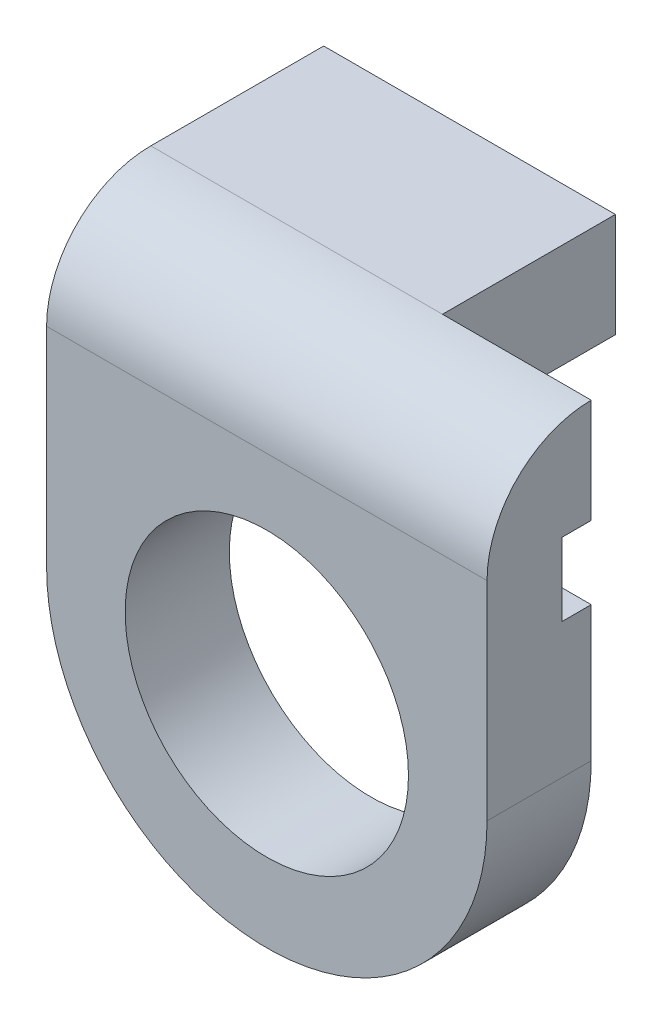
ISO-10303-21;
HEADER;
FILE_DESCRIPTION(('STEP AP214'),'2;1');
FILE_NAME('part.step','',(''),(''),'','','');
FILE_SCHEMA(('AUTOMOTIVE_DESIGN { 1 0 10303 214 1 1 1 1 }'));
ENDSEC;
DATA;
#1=APPLICATION_CONTEXT('core data for automotive mechanical design processes');
#2=APPLICATION_PROTOCOL_DEFINITION('international standard','automotive_design',2000,#1);
#3=PRODUCT_CONTEXT('',#1,'mechanical');
#4=PRODUCT('Part','Part','',(#3));
#5=PRODUCT_RELATED_PRODUCT_CATEGORY('part','',(#4));
#6=PRODUCT_DEFINITION_FORMATION('','',#4);
#7=PRODUCT_DEFINITION_CONTEXT('part definition',#1,'design');
#8=PRODUCT_DEFINITION('design','',#6,#7);
#9=PRODUCT_DEFINITION_SHAPE('','',#8);
#10=(LENGTH_UNIT() NAMED_UNIT(*) SI_UNIT(.MILLI.,.METRE.));
#11=(NAMED_UNIT(*) PLANE_ANGLE_UNIT() SI_UNIT($,.RADIAN.));
#12=(NAMED_UNIT(*) SI_UNIT($,.STERADIAN.) SOLID_ANGLE_UNIT());
#13=UNCERTAINTY_MEASURE_WITH_UNIT(LENGTH_MEASURE(1.E-05),#10,'distance_accuracy_value','');
#14=(GEOMETRIC_REPRESENTATION_CONTEXT(3) GLOBAL_UNCERTAINTY_ASSIGNED_CONTEXT((#13)) GLOBAL_UNIT_ASSIGNED_CONTEXT((#10,
#11,#12)) REPRESENTATION_CONTEXT('',''));
#15=CARTESIAN_POINT('',(0.,0.,0.));
#16=DIRECTION('',(0.,0.,1.));
#17=DIRECTION('',(1.,0.,0.));
#18=AXIS2_PLACEMENT_3D('',#15,#16,#17);
#19=CARTESIAN_POINT('',(-48.2574565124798,210.228483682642,-5.));
#20=DIRECTION('',(0.,0.,-1.));
#21=DIRECTION('',(-1.,0.,0.));
#22=AXIS2_PLACEMENT_3D('',#19,#20,#21);
#23=PLANE('',#22);
#24=DIRECTION('',(-1.,0.,0.));
#25=VECTOR('',#24,1.);
#26=CARTESIAN_POINT('',(-37.6880682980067,220.214717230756,-5.));
#27=LINE('',#26,#25);
#28=CARTESIAN_POINT('',(-37.6880932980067,220.214717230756,-5.));
#29=VERTEX_POINT('',#28);
#30=CARTESIAN_POINT('',(-44.8268197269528,220.214717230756,-5.));
#31=VERTEX_POINT('',#30);
#32=EDGE_CURVE('E215',#29,#31,#27,.T.);
#33=ORIENTED_EDGE('',*,*,#32,.T.);
#34=DIRECTION('',(0.,-1.,0.));
#35=VECTOR('',#34,1.);
#36=CARTESIAN_POINT('',(-44.8268197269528,220.214717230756,-5.));
#37=LINE('',#36,#35);
#38=CARTESIAN_POINT('',(-44.8268197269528,225.214717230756,-5.));
#39=VERTEX_POINT('',#38);
#40=EDGE_CURVE('E178',#39,#31,#37,.T.);
#41=ORIENTED_EDGE('',*,*,#40,.F.);
#42=DIRECTION('',(-1.,0.,0.));
#43=VECTOR('',#42,1.);
#44=CARTESIAN_POINT('',(-58.8268197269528,225.214717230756,-5.));
#45=LINE('',#44,#43);
#46=CARTESIAN_POINT('',(-37.6880932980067,225.214717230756,-5.));
#47=VERTEX_POINT('',#46);
#48=EDGE_CURVE('E150',#47,#39,#45,.T.);
#49=ORIENTED_EDGE('',*,*,#48,.F.);
#50=DIRECTION('',(0.,1.,0.));
#51=VECTOR('',#50,1.);
#52=CARTESIAN_POINT('',(-37.6880932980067,225.214717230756,-5.));
#53=LINE('',#52,#51);
#54=EDGE_CURVE('E152',#29,#47,#53,.T.);
#55=ORIENTED_EDGE('',*,*,#54,.F.);
#56=EDGE_LOOP('',(#33,#41,#49,#55));
#57=FACE_BOUND('',#56,.T.);
#58=ADVANCED_FACE('F32',(#57),#23,.T.);
#59=CARTESIAN_POINT('',(-58.8268197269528,225.214717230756,-5.));
#60=DIRECTION('',(0.,1.,0.));
#61=DIRECTION('',(-1.,0.,0.));
#62=AXIS2_PLACEMENT_3D('',#59,#60,#61);
#63=PLANE('',#62);
#64=DIRECTION('',(0.,0.,1.));
#65=VECTOR('',#64,1.);
#66=CARTESIAN_POINT('',(-58.8268197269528,225.214717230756,-5.));
#67=LINE('',#66,#65);
#68=CARTESIAN_POINT('',(-58.8268197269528,225.214717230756,-13.3));
#69=VERTEX_POINT('',#68);
#70=CARTESIAN_POINT('',(-58.8268197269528,225.214717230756,-5.));
#71=VERTEX_POINT('',#70);
#72=EDGE_CURVE('E172',#69,#71,#67,.T.);
#73=ORIENTED_EDGE('',*,*,#72,.T.);
#74=DIRECTION('',(-1.,0.,0.));
#75=VECTOR('',#74,1.);
#76=CARTESIAN_POINT('',(-37.6880932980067,225.214717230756,-5.));
#77=LINE('',#76,#75);
#78=EDGE_CURVE('E40',#71,#39,#77,.F.);
#79=ORIENTED_EDGE('',*,*,#78,.T.);
#80=DIRECTION('',(0.,0.,1.));
#81=VECTOR('',#80,1.);
#82=CARTESIAN_POINT('',(-44.8268197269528,225.214717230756,-13.3));
#83=LINE('',#82,#81);
#84=CARTESIAN_POINT('',(-44.8268197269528,225.214717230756,-13.3));
#85=VERTEX_POINT('',#84);
#86=EDGE_CURVE('E185',#85,#39,#83,.T.);
#87=ORIENTED_EDGE('',*,*,#86,.F.);
#88=DIRECTION('',(1.,0.,0.));
#89=VECTOR('',#88,1.);
#90=CARTESIAN_POINT('',(-58.8268197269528,225.214717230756,-13.3));
#91=LINE('',#90,#89);
#92=EDGE_CURVE('E181',#69,#85,#91,.T.);
#93=ORIENTED_EDGE('',*,*,#92,.F.);
#94=EDGE_LOOP('',(#73,#79,#87,#93));
#95=FACE_BOUND('',#94,.T.);
#96=ADVANCED_FACE('F34',(#95),#63,.T.);
#97=CARTESIAN_POINT('',(-37.6880932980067,225.214717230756,-5.));
#98=DIRECTION('',(1.,0.,0.));
#99=DIRECTION('',(0.,0.,-1.));
#100=AXIS2_PLACEMENT_3D('',#97,#98,#99);
#101=PLANE('',#100);
#102=ORIENTED_EDGE('',*,*,#54,.T.);
#103=CARTESIAN_POINT('',(-37.6880932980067,220.214717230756,-5.));
#104=DIRECTION('',(1.,0.,0.));
#105=DIRECTION('',(0.,0.,-1.));
#106=AXIS2_PLACEMENT_3D('',#103,#104,#105);
#107=CIRCLE('',#106,5.);
#108=CARTESIAN_POINT('',(-37.6880932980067,220.214717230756,0.));
#109=VERTEX_POINT('',#108);
#110=EDGE_CURVE('E11',#47,#109,#107,.T.);
#111=ORIENTED_EDGE('',*,*,#110,.T.);
#112=DIRECTION('',(0.,1.,0.));
#113=VECTOR('',#112,1.);
#114=CARTESIAN_POINT('',(-37.6880932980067,225.214717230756,0.));
#115=LINE('',#114,#113);
#116=CARTESIAN_POINT('',(-37.6880932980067,210.228483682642,0.));
#117=VERTEX_POINT('',#116);
#118=EDGE_CURVE('E155',#117,#109,#115,.T.);
#119=ORIENTED_EDGE('',*,*,#118,.F.);
#120=DIRECTION('',(0.,0.,1.));
#121=VECTOR('',#120,1.);
#122=CARTESIAN_POINT('',(-37.6880932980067,210.228483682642,-5.));
#123=LINE('',#122,#121);
#124=CARTESIAN_POINT('',(-37.6880932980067,210.228483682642,-5.));
#125=VERTEX_POINT('',#124);
#126=EDGE_CURVE('E173',#125,#117,#123,.T.);
#127=ORIENTED_EDGE('',*,*,#126,.F.);
#128=CARTESIAN_POINT('',(-37.6880932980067,216.714717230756,-5.));
#129=VERTEX_POINT('',#128);
#130=EDGE_CURVE('E169',#125,#129,#53,.T.);
#131=ORIENTED_EDGE('',*,*,#130,.T.);
#132=DIRECTION('',(0.,0.,-1.));
#133=VECTOR('',#132,1.);
#134=CARTESIAN_POINT('',(-37.6880932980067,216.714717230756,-5.00000000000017));
#135=LINE('',#134,#133);
#136=CARTESIAN_POINT('',(-37.6880932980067,216.714717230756,-3.6));
#137=VERTEX_POINT('',#136);
#138=EDGE_CURVE('E263',#137,#129,#135,.T.);
#139=ORIENTED_EDGE('',*,*,#138,.F.);
#140=DIRECTION('',(0.,-1.,0.));
#141=VECTOR('',#140,1.);
#142=CARTESIAN_POINT('',(-37.6880932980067,225.214717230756,-3.6));
#143=LINE('',#142,#141);
#144=CARTESIAN_POINT('',(-37.6880932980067,220.214717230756,-3.6));
#145=VERTEX_POINT('',#144);
#146=EDGE_CURVE('E182',#145,#137,#143,.T.);
#147=ORIENTED_EDGE('',*,*,#146,.F.);
#148=DIRECTION('',(0.,0.,1.));
#149=VECTOR('',#148,1.);
#150=CARTESIAN_POINT('',(-37.6880932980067,220.214717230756,-5.));
#151=LINE('',#150,#149);
#152=EDGE_CURVE('E258',#29,#145,#151,.T.);
#153=ORIENTED_EDGE('',*,*,#152,.F.);
#154=EDGE_LOOP('',(#102,#111,#119,#127,#131,#139,#147,#153));
#155=FACE_BOUND('',#154,.T.);
#156=ADVANCED_FACE('F236',(#155),#101,.T.);
#157=CARTESIAN_POINT('',(-48.2574565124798,210.228483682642,-5.));
#158=DIRECTION('',(0.,0.,1.));
#159=DIRECTION('',(1.,0.,0.));
#160=AXIS2_PLACEMENT_3D('',#157,#158,#159);
#161=CYLINDRICAL_SURFACE('',#160,10.5693632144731);
#162=CARTESIAN_POINT('',(-48.2574565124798,210.228483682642,0.));
#163=DIRECTION('',(0.,0.,1.));
#164=DIRECTION('',(-1.,0.,0.));
#165=AXIS2_PLACEMENT_3D('',#162,#163,#164);
#166=CIRCLE('',#165,10.5693632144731);
#167=CARTESIAN_POINT('',(-58.8268197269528,210.228483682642,0.));
#168=VERTEX_POINT('',#167);
#169=EDGE_CURVE('E284',#168,#117,#166,.T.);
#170=ORIENTED_EDGE('',*,*,#169,.F.);
#171=DIRECTION('',(0.,0.,1.));
#172=VECTOR('',#171,1.);
#173=CARTESIAN_POINT('',(-58.8268197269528,210.228483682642,-5.));
#174=LINE('',#173,#172);
#175=CARTESIAN_POINT('',(-58.8268197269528,210.228483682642,-5.));
#176=VERTEX_POINT('',#175);
#177=EDGE_CURVE('E175',#176,#168,#174,.T.);
#178=ORIENTED_EDGE('',*,*,#177,.F.);
#179=CARTESIAN_POINT('',(-48.2574565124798,210.228483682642,-5.));
#180=DIRECTION('',(0.,0.,1.));
#181=DIRECTION('',(-1.,0.,0.));
#182=AXIS2_PLACEMENT_3D('',#179,#180,#181);
#183=CIRCLE('',#182,10.5693632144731);
#184=EDGE_CURVE('E149',#176,#125,#183,.T.);
#185=ORIENTED_EDGE('',*,*,#184,.T.);
#186=ORIENTED_EDGE('',*,*,#126,.T.);
#187=EDGE_LOOP('',(#170,#178,#185,#186));
#188=FACE_BOUND('',#187,.T.);
#189=ADVANCED_FACE('F247',(#188),#161,.T.);
#190=CARTESIAN_POINT('',(-58.8268197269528,210.228483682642,-5.));
#191=DIRECTION('',(-1.,0.,0.));
#192=DIRECTION('',(0.,0.,1.));
#193=AXIS2_PLACEMENT_3D('',#190,#191,#192);
#194=PLANE('',#193);
#195=DIRECTION('',(0.,-1.,0.));
#196=VECTOR('',#195,1.);
#197=CARTESIAN_POINT('',(-58.8268197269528,210.228483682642,0.));
#198=LINE('',#197,#196);
#199=CARTESIAN_POINT('',(-58.8268197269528,220.214717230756,0.));
#200=VERTEX_POINT('',#199);
#201=EDGE_CURVE('E282',#200,#168,#198,.T.);
#202=ORIENTED_EDGE('',*,*,#201,.F.);
#203=CARTESIAN_POINT('',(-58.8268197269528,220.214717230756,-5.));
#204=DIRECTION('',(-1.,0.,0.));
#205=DIRECTION('',(0.,0.,1.));
#206=AXIS2_PLACEMENT_3D('',#203,#204,#205);
#207=CIRCLE('',#206,5.);
#208=EDGE_CURVE('E47',#200,#71,#207,.T.);
#209=ORIENTED_EDGE('',*,*,#208,.T.);
#210=ORIENTED_EDGE('',*,*,#72,.F.);
#211=DIRECTION('',(0.,1.,0.));
#212=VECTOR('',#211,1.);
#213=CARTESIAN_POINT('',(-58.8268197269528,225.214717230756,-13.3));
#214=LINE('',#213,#212);
#215=CARTESIAN_POINT('',(-58.8268197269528,220.214717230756,-13.3));
#216=VERTEX_POINT('',#215);
#217=EDGE_CURVE('E194',#216,#69,#214,.T.);
#218=ORIENTED_EDGE('',*,*,#217,.F.);
#219=DIRECTION('',(0.,0.,1.));
#220=VECTOR('',#219,1.);
#221=CARTESIAN_POINT('',(-58.8268197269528,220.214717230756,-13.3));
#222=LINE('',#221,#220);
#223=CARTESIAN_POINT('',(-58.8268197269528,220.214717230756,-3.6));
#224=VERTEX_POINT('',#223);
#225=EDGE_CURVE('E192',#216,#224,#222,.T.);
#226=ORIENTED_EDGE('',*,*,#225,.T.);
#227=DIRECTION('',(0.,1.,0.));
#228=VECTOR('',#227,1.);
#229=CARTESIAN_POINT('',(-58.8268197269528,220.214717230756,-3.6));
#230=LINE('',#229,#228);
#231=CARTESIAN_POINT('',(-58.8268197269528,216.714717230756,-3.6));
#232=VERTEX_POINT('',#231);
#233=EDGE_CURVE('E136',#232,#224,#230,.T.);
#234=ORIENTED_EDGE('',*,*,#233,.F.);
#235=DIRECTION('',(0.,0.,1.));
#236=VECTOR('',#235,1.);
#237=CARTESIAN_POINT('',(-58.8268197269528,216.714717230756,-5.));
#238=LINE('',#237,#236);
#239=CARTESIAN_POINT('',(-58.8268197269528,216.714717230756,-5.));
#240=VERTEX_POINT('',#239);
#241=EDGE_CURVE('E127',#240,#232,#238,.T.);
#242=ORIENTED_EDGE('',*,*,#241,.F.);
#243=DIRECTION('',(0.,-1.,0.));
#244=VECTOR('',#243,1.);
#245=CARTESIAN_POINT('',(-58.8268197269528,210.228483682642,-5.));
#246=LINE('',#245,#244);
#247=EDGE_CURVE('E140',#240,#176,#246,.T.);
#248=ORIENTED_EDGE('',*,*,#247,.T.);
#249=ORIENTED_EDGE('',*,*,#177,.T.);
#250=EDGE_LOOP('',(#202,#209,#210,#218,#226,#234,#242,#248,#249));
#251=FACE_BOUND('',#250,.T.);
#252=ADVANCED_FACE('F138',(#251),#194,.T.);
#253=DIRECTION('',(-1.,0.,0.));
#254=VECTOR('',#253,1.);
#255=CARTESIAN_POINT('',(-37.6880682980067,216.714717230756,-5.));
#256=LINE('',#255,#254);
#257=CARTESIAN_POINT('',(-46.2199377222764,216.714717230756,-5.));
#258=VERTEX_POINT('',#257);
#259=EDGE_CURVE('E135',#129,#258,#256,.T.);
#260=ORIENTED_EDGE('',*,*,#259,.F.);
#261=ORIENTED_EDGE('',*,*,#130,.F.);
#262=ORIENTED_EDGE('',*,*,#184,.F.);
#263=ORIENTED_EDGE('',*,*,#247,.F.);
#264=CARTESIAN_POINT('',(-50.2949753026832,216.714717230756,-5.));
#265=VERTEX_POINT('',#264);
#266=EDGE_CURVE('E123',#265,#240,#256,.T.);
#267=ORIENTED_EDGE('',*,*,#266,.F.);
#268=CARTESIAN_POINT('',(-48.2574565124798,210.228483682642,-5.));
#269=DIRECTION('',(0.,0.,1.));
#270=DIRECTION('',(1.,0.,0.));
#271=AXIS2_PLACEMENT_3D('',#268,#269,#270);
#272=CIRCLE('',#271,6.79872844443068);
#273=EDGE_CURVE('E280',#265,#258,#272,.T.);
#274=ORIENTED_EDGE('',*,*,#273,.T.);
#275=EDGE_LOOP('',(#260,#261,#262,#263,#267,#274));
#276=FACE_BOUND('',#275,.T.);
#277=ADVANCED_FACE('F146',(#276),#23,.T.);
#278=CARTESIAN_POINT('',(-48.2574565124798,210.228483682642,0.));
#279=DIRECTION('',(0.,0.,-1.));
#280=DIRECTION('',(-1.,0.,0.));
#281=AXIS2_PLACEMENT_3D('',#278,#279,#280);
#282=PLANE('',#281);
#283=CARTESIAN_POINT('',(-48.2574565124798,210.228483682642,0.));
#284=DIRECTION('',(0.,0.,1.));
#285=DIRECTION('',(1.,0.,0.));
#286=AXIS2_PLACEMENT_3D('',#283,#284,#285);
#287=CIRCLE('',#286,6.79872844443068);
#288=CARTESIAN_POINT('',(-41.4587280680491,210.228483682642,0.));
#289=VERTEX_POINT('',#288);
#290=EDGE_CURVE('E188',#289,#289,#287,.T.);
#291=ORIENTED_EDGE('',*,*,#290,.F.);
#292=EDGE_LOOP('',(#291));
#293=FACE_BOUND('',#292,.T.);
#294=ORIENTED_EDGE('',*,*,#118,.T.);
#295=DIRECTION('',(-1.,0.,0.));
#296=VECTOR('',#295,1.);
#297=CARTESIAN_POINT('',(-58.8268197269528,220.214717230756,0.));
#298=LINE('',#297,#296);
#299=EDGE_CURVE('E162',#109,#200,#298,.T.);
#300=ORIENTED_EDGE('',*,*,#299,.T.);
#301=ORIENTED_EDGE('',*,*,#201,.T.);
#302=ORIENTED_EDGE('',*,*,#169,.T.);
#303=EDGE_LOOP('',(#294,#300,#301,#302));
#304=FACE_BOUND('',#303,.T.);
#305=ADVANCED_FACE('F240',(#293,#304),#282,.F.);
#306=CARTESIAN_POINT('',(-48.2574565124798,210.228483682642,-5.));
#307=DIRECTION('',(0.,0.,1.));
#308=DIRECTION('',(1.,0.,0.));
#309=AXIS2_PLACEMENT_3D('',#306,#307,#308);
#310=CYLINDRICAL_SURFACE('',#309,6.79872844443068);
#311=CARTESIAN_POINT('',(-48.2574565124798,210.228483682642,-3.6));
#312=DIRECTION('',(0.,0.,1.));
#313=DIRECTION('',(0.,-1.,0.));
#314=AXIS2_PLACEMENT_3D('',#311,#312,#313);
#315=CIRCLE('',#314,6.79872844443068);
#316=CARTESIAN_POINT('',(-50.2949753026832,216.714717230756,-3.6));
#317=VERTEX_POINT('',#316);
#318=CARTESIAN_POINT('',(-46.2199377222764,216.714717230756,-3.6));
#319=VERTEX_POINT('',#318);
#320=EDGE_CURVE('E197',#317,#319,#315,.F.);
#321=ORIENTED_EDGE('',*,*,#320,.T.);
#322=DIRECTION('',(0.,0.,1.));
#323=VECTOR('',#322,1.);
#324=CARTESIAN_POINT('',(-46.2199377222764,216.714717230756,-4.99999999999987));
#325=LINE('',#324,#323);
#326=EDGE_CURVE('E160',#319,#258,#325,.F.);
#327=ORIENTED_EDGE('',*,*,#326,.T.);
#328=ORIENTED_EDGE('',*,*,#273,.F.);
#329=DIRECTION('',(0.,0.,1.));
#330=VECTOR('',#329,1.);
#331=CARTESIAN_POINT('',(-50.2949753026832,216.714717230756,-4.99999999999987));
#332=LINE('',#331,#330);
#333=EDGE_CURVE('E130',#265,#317,#332,.T.);
#334=ORIENTED_EDGE('',*,*,#333,.T.);
#335=EDGE_LOOP('',(#321,#327,#328,#334));
#336=FACE_BOUND('',#335,.T.);
#337=ORIENTED_EDGE('',*,*,#290,.T.);
#338=EDGE_LOOP('',(#337));
#339=FACE_BOUND('',#338,.T.);
#340=ADVANCED_FACE('F245',(#336,#339),#310,.F.);
#341=CARTESIAN_POINT('',(-44.8268197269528,220.214717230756,-13.3));
#342=DIRECTION('',(-1.,0.,0.));
#343=DIRECTION('',(0.,-1.,0.));
#344=AXIS2_PLACEMENT_3D('',#341,#342,#343);
#345=PLANE('',#344);
#346=ORIENTED_EDGE('',*,*,#40,.T.);
#347=DIRECTION('',(0.,0.,1.));
#348=VECTOR('',#347,1.);
#349=CARTESIAN_POINT('',(-44.8268197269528,220.214717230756,-13.3));
#350=LINE('',#349,#348);
#351=CARTESIAN_POINT('',(-44.8268197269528,220.214717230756,-13.3));
#352=VERTEX_POINT('',#351);
#353=EDGE_CURVE('E189',#352,#31,#350,.T.);
#354=ORIENTED_EDGE('',*,*,#353,.F.);
#355=DIRECTION('',(0.,-1.,0.));
#356=VECTOR('',#355,1.);
#357=CARTESIAN_POINT('',(-44.8268197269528,220.214717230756,-13.3));
#358=LINE('',#357,#356);
#359=EDGE_CURVE('E220',#85,#352,#358,.T.);
#360=ORIENTED_EDGE('',*,*,#359,.F.);
#361=ORIENTED_EDGE('',*,*,#86,.T.);
#362=EDGE_LOOP('',(#346,#354,#360,#361));
#363=FACE_BOUND('',#362,.T.);
#364=ADVANCED_FACE('F219',(#363),#345,.F.);
#365=CARTESIAN_POINT('',(-58.8268197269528,220.214717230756,-13.3));
#366=DIRECTION('',(0.,1.,0.));
#367=DIRECTION('',(0.,0.,1.));
#368=AXIS2_PLACEMENT_3D('',#365,#366,#367);
#369=PLANE('',#368);
#370=ORIENTED_EDGE('',*,*,#353,.T.);
#371=ORIENTED_EDGE('',*,*,#32,.F.);
#372=ORIENTED_EDGE('',*,*,#152,.T.);
#373=DIRECTION('',(-1.,0.,0.));
#374=VECTOR('',#373,1.);
#375=CARTESIAN_POINT('',(-37.6880682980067,220.214717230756,-3.6));
#376=LINE('',#375,#374);
#377=EDGE_CURVE('E266',#145,#224,#376,.T.);
#378=ORIENTED_EDGE('',*,*,#377,.T.);
#379=ORIENTED_EDGE('',*,*,#225,.F.);
#380=DIRECTION('',(-1.,0.,0.));
#381=VECTOR('',#380,1.);
#382=CARTESIAN_POINT('',(-58.8268197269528,220.214717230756,-13.3));
#383=LINE('',#382,#381);
#384=EDGE_CURVE('E273',#352,#216,#383,.T.);
#385=ORIENTED_EDGE('',*,*,#384,.F.);
#386=EDGE_LOOP('',(#370,#371,#372,#378,#379,#385));
#387=FACE_BOUND('',#386,.T.);
#388=ADVANCED_FACE('F297',(#387),#369,.F.);
#389=CARTESIAN_POINT('',(-44.8268197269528,225.214717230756,-13.3));
#390=DIRECTION('',(0.,0.,1.));
#391=DIRECTION('',(1.,0.,0.));
#392=AXIS2_PLACEMENT_3D('',#389,#390,#391);
#393=PLANE('',#392);
#394=ORIENTED_EDGE('',*,*,#92,.T.);
#395=ORIENTED_EDGE('',*,*,#359,.T.);
#396=ORIENTED_EDGE('',*,*,#384,.T.);
#397=ORIENTED_EDGE('',*,*,#217,.T.);
#398=EDGE_LOOP('',(#394,#395,#396,#397));
#399=FACE_BOUND('',#398,.T.);
#400=ADVANCED_FACE('F301',(#399),#393,.F.);
#401=CARTESIAN_POINT('',(-37.6880682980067,220.214717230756,-3.6));
#402=DIRECTION('',(0.,0.,1.));
#403=DIRECTION('',(0.,-1.,0.));
#404=AXIS2_PLACEMENT_3D('',#401,#402,#403);
#405=PLANE('',#404);
#406=ORIENTED_EDGE('',*,*,#146,.T.);
#407=DIRECTION('',(-1.,0.,0.));
#408=VECTOR('',#407,1.);
#409=CARTESIAN_POINT('',(-37.6880682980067,216.714717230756,-3.6));
#410=LINE('',#409,#408);
#411=EDGE_CURVE('E289',#137,#319,#410,.T.);
#412=ORIENTED_EDGE('',*,*,#411,.T.);
#413=ORIENTED_EDGE('',*,*,#320,.F.);
#414=EDGE_CURVE('E288',#317,#232,#410,.T.);
#415=ORIENTED_EDGE('',*,*,#414,.T.);
#416=ORIENTED_EDGE('',*,*,#233,.T.);
#417=ORIENTED_EDGE('',*,*,#377,.F.);
#418=EDGE_LOOP('',(#406,#412,#413,#415,#416,#417));
#419=FACE_BOUND('',#418,.T.);
#420=ADVANCED_FACE('F294',(#419),#405,.F.);
#421=CARTESIAN_POINT('',(-37.6880682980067,216.714717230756,-5.));
#422=DIRECTION('',(0.,-1.,0.));
#423=DIRECTION('',(0.,0.,-1.));
#424=AXIS2_PLACEMENT_3D('',#421,#422,#423);
#425=PLANE('',#424);
#426=ORIENTED_EDGE('',*,*,#138,.T.);
#427=ORIENTED_EDGE('',*,*,#259,.T.);
#428=ORIENTED_EDGE('',*,*,#326,.F.);
#429=ORIENTED_EDGE('',*,*,#411,.F.);
#430=EDGE_LOOP('',(#426,#427,#428,#429));
#431=FACE_BOUND('',#430,.T.);
#432=ADVANCED_FACE('F228',(#431),#425,.F.);
#433=ORIENTED_EDGE('',*,*,#266,.T.);
#434=ORIENTED_EDGE('',*,*,#241,.T.);
#435=ORIENTED_EDGE('',*,*,#414,.F.);
#436=ORIENTED_EDGE('',*,*,#333,.F.);
#437=EDGE_LOOP('',(#433,#434,#435,#436));
#438=FACE_BOUND('',#437,.T.);
#439=ADVANCED_FACE('F125',(#438),#425,.F.);
#440=CARTESIAN_POINT('',(-48.2574565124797,220.214717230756,-5.));
#441=DIRECTION('',(1.,0.,0.));
#442=DIRECTION('',(0.,1.,0.));
#443=AXIS2_PLACEMENT_3D('',#440,#441,#442);
#444=CYLINDRICAL_SURFACE('',#443,5.);
#445=ORIENTED_EDGE('',*,*,#48,.T.);
#446=ORIENTED_EDGE('',*,*,#78,.F.);
#447=ORIENTED_EDGE('',*,*,#208,.F.);
#448=ORIENTED_EDGE('',*,*,#299,.F.);
#449=ORIENTED_EDGE('',*,*,#110,.F.);
#450=EDGE_LOOP('',(#445,#446,#447,#448,#449));
#451=FACE_BOUND('',#450,.T.);
#452=ADVANCED_FACE('F222',(#451),#444,.T.);
#453=CLOSED_SHELL('',(#58,#96,#156,#189,#252,#277,#305,#340,#364,#388,#400,#420,#432,#439,#452));
#454=MANIFOLD_SOLID_BREP('B2',#453);
#455=ADVANCED_BREP_SHAPE_REPRESENTATION('',(#18,#454),#14);
#456=SHAPE_DEFINITION_REPRESENTATION(#9,#455);
ENDSEC;
END-ISO-10303-21;
